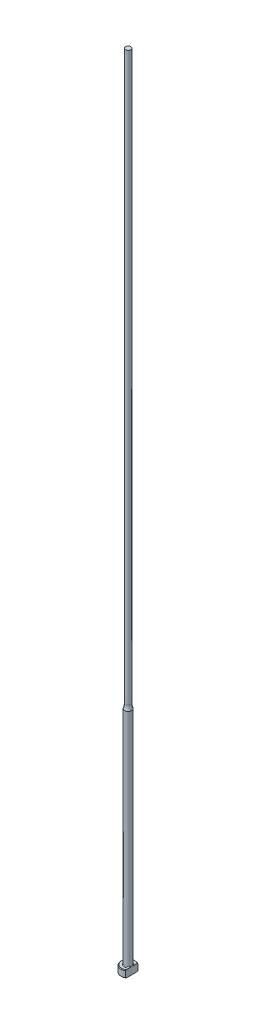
ISO-10303-21;
HEADER;
FILE_DESCRIPTION(('STEP AP214'),'2;1');
FILE_NAME('part.step','',(''),(''),'','','');
FILE_SCHEMA(('AUTOMOTIVE_DESIGN { 1 0 10303 214 1 1 1 1 }'));
ENDSEC;
DATA;
#1=APPLICATION_CONTEXT('core data for automotive mechanical design processes');
#2=APPLICATION_PROTOCOL_DEFINITION('international standard','automotive_design',2000,#1);
#3=PRODUCT_CONTEXT('',#1,'mechanical');
#4=PRODUCT('Part','Part','',(#3));
#5=PRODUCT_RELATED_PRODUCT_CATEGORY('part','',(#4));
#6=PRODUCT_DEFINITION_FORMATION('','',#4);
#7=PRODUCT_DEFINITION_CONTEXT('part definition',#1,'design');
#8=PRODUCT_DEFINITION('design','',#6,#7);
#9=PRODUCT_DEFINITION_SHAPE('','',#8);
#10=(LENGTH_UNIT() NAMED_UNIT(*) SI_UNIT(.MILLI.,.METRE.));
#11=(NAMED_UNIT(*) PLANE_ANGLE_UNIT() SI_UNIT($,.RADIAN.));
#12=(NAMED_UNIT(*) SI_UNIT($,.STERADIAN.) SOLID_ANGLE_UNIT());
#13=UNCERTAINTY_MEASURE_WITH_UNIT(LENGTH_MEASURE(1.E-05),#10,'distance_accuracy_value','');
#14=(GEOMETRIC_REPRESENTATION_CONTEXT(3) GLOBAL_UNCERTAINTY_ASSIGNED_CONTEXT((#13)) GLOBAL_UNIT_ASSIGNED_CONTEXT((#10,
#11,#12)) REPRESENTATION_CONTEXT('',''));
#15=CARTESIAN_POINT('',(0.,0.,0.));
#16=DIRECTION('',(0.,0.,1.));
#17=DIRECTION('',(1.,0.,0.));
#18=AXIS2_PLACEMENT_3D('',#15,#16,#17);
#19=CARTESIAN_POINT('',(-3.17499999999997,3.175,0.));
#20=DIRECTION('',(0.,1.,0.));
#21=DIRECTION('',(0.,0.,1.));
#22=AXIS2_PLACEMENT_3D('',#19,#20,#21);
#23=PLANE('',#22);
#24=CARTESIAN_POINT('',(0.,3.175,0.));
#25=DIRECTION('',(0.,1.,0.));
#26=DIRECTION('',(0.,0.,1.));
#27=AXIS2_PLACEMENT_3D('',#24,#25,#26);
#28=CIRCLE('',#27,2.92099999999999);
#29=CARTESIAN_POINT('',(1.58749999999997,3.175,-2.4519552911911));
#30=VERTEX_POINT('',#29);
#31=CARTESIAN_POINT('',(1.58749999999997,3.175,2.4519552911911));
#32=VERTEX_POINT('',#31);
#33=EDGE_CURVE('E105',#30,#32,#28,.T.);
#34=ORIENTED_EDGE('',*,*,#33,.T.);
#35=DIRECTION('',(0.,0.,1.));
#36=VECTOR('',#35,1.);
#37=CARTESIAN_POINT('',(1.58749999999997,3.17499999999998,2.74963065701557));
#38=LINE('',#37,#36);
#39=CARTESIAN_POINT('',(1.58749999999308,3.175,0.933255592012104));
#40=VERTEX_POINT('',#39);
#41=EDGE_CURVE('E126',#40,#32,#38,.T.);
#42=ORIENTED_EDGE('',*,*,#41,.F.);
#43=CARTESIAN_POINT('',(0.,3.175,0.));
#44=DIRECTION('',(0.,1.,0.));
#45=DIRECTION('',(0.,0.,1.));
#46=AXIS2_PLACEMENT_3D('',#43,#44,#45);
#47=CIRCLE('',#46,1.84149999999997);
#48=CARTESIAN_POINT('',(1.58749999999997,3.17500000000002,-0.933255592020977));
#49=VERTEX_POINT('',#48);
#50=EDGE_CURVE('E11',#40,#49,#47,.F.);
#51=ORIENTED_EDGE('',*,*,#50,.T.);
#52=EDGE_CURVE('E52',#30,#49,#38,.T.);
#53=ORIENTED_EDGE('',*,*,#52,.F.);
#54=EDGE_LOOP('',(#34,#42,#51,#53));
#55=FACE_BOUND('',#54,.T.);
#56=ADVANCED_FACE('F32',(#55),#23,.T.);
#57=CARTESIAN_POINT('',(0.,259.958771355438,0.));
#58=DIRECTION('',(0.,1.,0.));
#59=DIRECTION('',(0.,0.,1.));
#60=AXIS2_PLACEMENT_3D('',#57,#58,#59);
#61=CYLINDRICAL_SURFACE('',#60,3.17499999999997);
#62=CARTESIAN_POINT('',(0.,2.92100000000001,0.));
#63=DIRECTION('',(0.,1.,0.));
#64=DIRECTION('',(0.,0.,1.));
#65=AXIS2_PLACEMENT_3D('',#62,#63,#64);
#66=CIRCLE('',#65,3.17499999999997);
#67=CARTESIAN_POINT('',(1.58749999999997,2.92100000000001,2.74963065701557));
#68=VERTEX_POINT('',#67);
#69=CARTESIAN_POINT('',(1.58749999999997,2.92100000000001,-2.74963065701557));
#70=VERTEX_POINT('',#69);
#71=EDGE_CURVE('E98',#68,#70,#66,.F.);
#72=ORIENTED_EDGE('',*,*,#71,.T.);
#73=DIRECTION('',(0.,-1.,0.));
#74=VECTOR('',#73,1.);
#75=CARTESIAN_POINT('',(1.58749999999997,355.601,-2.74963065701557));
#76=LINE('',#75,#74);
#77=CARTESIAN_POINT('',(1.58749999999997,0.253999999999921,-2.74963065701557));
#78=VERTEX_POINT('',#77);
#79=EDGE_CURVE('E141',#70,#78,#76,.T.);
#80=ORIENTED_EDGE('',*,*,#79,.T.);
#81=CARTESIAN_POINT('',(0.,0.253999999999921,0.));
#82=DIRECTION('',(0.,-1.,0.));
#83=DIRECTION('',(0.,0.,-1.));
#84=AXIS2_PLACEMENT_3D('',#81,#82,#83);
#85=CIRCLE('',#84,3.17499999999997);
#86=CARTESIAN_POINT('',(1.58749999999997,0.253999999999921,2.74963065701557));
#87=VERTEX_POINT('',#86);
#88=EDGE_CURVE('E95',#78,#87,#85,.F.);
#89=ORIENTED_EDGE('',*,*,#88,.T.);
#90=DIRECTION('',(0.,-1.,0.));
#91=VECTOR('',#90,1.);
#92=CARTESIAN_POINT('',(1.58749999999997,355.601,2.74963065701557));
#93=LINE('',#92,#91);
#94=EDGE_CURVE('E88',#68,#87,#93,.T.);
#95=ORIENTED_EDGE('',*,*,#94,.F.);
#96=EDGE_LOOP('',(#72,#80,#89,#95));
#97=FACE_BOUND('',#96,.T.);
#98=ADVANCED_FACE('F191',(#97),#61,.T.);
#99=CARTESIAN_POINT('',(0.,0.,0.));
#100=DIRECTION('',(0.,-1.,0.));
#101=DIRECTION('',(0.,0.,-1.));
#102=AXIS2_PLACEMENT_3D('',#99,#100,#101);
#103=PLANE('',#102);
#104=CARTESIAN_POINT('',(0.,0.,0.));
#105=DIRECTION('',(0.,-1.,0.));
#106=DIRECTION('',(0.,0.,-1.));
#107=AXIS2_PLACEMENT_3D('',#104,#105,#106);
#108=CIRCLE('',#107,2.92100000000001);
#109=CARTESIAN_POINT('',(1.58749999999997,0.,2.45195529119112));
#110=VERTEX_POINT('',#109);
#111=CARTESIAN_POINT('',(1.58749999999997,0.,-2.45195529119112));
#112=VERTEX_POINT('',#111);
#113=EDGE_CURVE('E93',#110,#112,#108,.T.);
#114=ORIENTED_EDGE('',*,*,#113,.T.);
#115=DIRECTION('',(0.,0.,1.));
#116=VECTOR('',#115,1.);
#117=CARTESIAN_POINT('',(1.58749999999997,0.,2.74963065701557));
#118=LINE('',#117,#116);
#119=EDGE_CURVE('E78',#112,#110,#118,.T.);
#120=ORIENTED_EDGE('',*,*,#119,.T.);
#121=EDGE_LOOP('',(#114,#120));
#122=FACE_BOUND('',#121,.T.);
#123=ADVANCED_FACE('F97',(#122),#103,.T.);
#124=CARTESIAN_POINT('',(0.,3.17499999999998,0.));
#125=DIRECTION('',(0.,-1.,0.));
#126=DIRECTION('',(0.,0.,-1.));
#127=AXIS2_PLACEMENT_3D('',#124,#125,#126);
#128=CONICAL_SURFACE('',#127,2.92100000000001,0.785398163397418);
#129=ORIENTED_EDGE('',*,*,#71,.F.);
#130=CARTESIAN_POINT('',(1.58749999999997,-0.161620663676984,-6.0529050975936));
#131=CARTESIAN_POINT('',(1.58749999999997,-0.0288893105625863,-5.91567682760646));
#132=CARTESIAN_POINT('',(1.58749999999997,0.103699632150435,-5.77831035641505));
#133=CARTESIAN_POINT('',(1.58749999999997,0.368508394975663,-5.50321874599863));
#134=CARTESIAN_POINT('',(1.58749999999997,0.5007282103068,-5.3654936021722));
#135=CARTESIAN_POINT('',(1.58749999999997,0.764778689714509,-5.08953516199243));
#136=CARTESIAN_POINT('',(1.58749999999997,0.896609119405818,-4.95130164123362));
#137=CARTESIAN_POINT('',(1.58749999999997,1.15968706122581,-4.67428233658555));
#138=CARTESIAN_POINT('',(1.58749999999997,1.29093457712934,-4.5354965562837));
#139=CARTESIAN_POINT('',(1.58749999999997,1.55007705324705,-4.25997724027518));
#140=CARTESIAN_POINT('',(1.58749999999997,1.67798684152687,-4.12325766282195));
#141=CARTESIAN_POINT('',(1.58749999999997,1.9328486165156,-3.84892898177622));
#142=CARTESIAN_POINT('',(1.58749999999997,2.05980060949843,-3.71131988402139));
#143=CARTESIAN_POINT('',(1.58749999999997,2.31237508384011,-3.43493978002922));
#144=CARTESIAN_POINT('',(1.58749999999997,2.43799784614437,-3.29616903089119));
#145=CARTESIAN_POINT('',(1.58749999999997,2.68741369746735,-3.01699558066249));
#146=CARTESIAN_POINT('',(1.58749999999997,2.81120686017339,-2.8765929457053));
#147=CARTESIAN_POINT('',(1.58749999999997,3.00875865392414,-2.64816703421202));
#148=CARTESIAN_POINT('',(1.58749999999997,3.08336151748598,-2.56087478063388));
#149=CARTESIAN_POINT('',(1.58749999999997,3.23123871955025,-2.385154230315));
#150=CARTESIAN_POINT('',(1.58749999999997,3.30451292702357,-2.29672582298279));
#151=CARTESIAN_POINT('',(1.58749999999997,3.45004422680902,-2.11747400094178));
#152=CARTESIAN_POINT('',(1.58749999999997,3.52228237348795,-2.02663514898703));
#153=CARTESIAN_POINT('',(1.58749999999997,3.66423097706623,-1.84302524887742));
#154=CARTESIAN_POINT('',(1.58749999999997,3.73394203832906,-1.75025467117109));
#155=CARTESIAN_POINT('',(1.58749999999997,3.87080633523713,-1.56067475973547));
#156=CARTESIAN_POINT('',(1.58749999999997,3.93790459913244,-1.46382547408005));
#157=CARTESIAN_POINT('',(1.58749999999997,4.06669147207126,-1.26632594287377));
#158=CARTESIAN_POINT('',(1.58749999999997,4.12837264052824,-1.16567073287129));
#159=CARTESIAN_POINT('',(1.58749999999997,4.21402252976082,-1.01165766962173));
#160=CARTESIAN_POINT('',(1.58749999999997,4.2412792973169,-0.960142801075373));
#161=CARTESIAN_POINT('',(1.58749999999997,4.29309798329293,-0.85578092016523));
#162=CARTESIAN_POINT('',(1.58749999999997,4.3176594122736,-0.802933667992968));
#163=CARTESIAN_POINT('',(1.58749999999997,4.38614656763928,-0.642461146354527));
#164=CARTESIAN_POINT('',(1.58749999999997,4.42510149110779,-0.532518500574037));
#165=CARTESIAN_POINT('',(1.58749999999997,4.46726244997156,-0.367680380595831));
#166=CARTESIAN_POINT('',(1.58749999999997,4.47844427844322,-0.314802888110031));
#167=CARTESIAN_POINT('',(1.58749999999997,4.49576654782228,-0.208209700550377));
#168=CARTESIAN_POINT('',(1.58749999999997,4.50190743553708,-0.154494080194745));
#169=CARTESIAN_POINT('',(1.58749999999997,4.50871296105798,-0.0468792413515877));
#170=CARTESIAN_POINT('',(1.58749999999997,4.50939451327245,0.00701889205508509));
#171=CARTESIAN_POINT('',(1.58749999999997,4.5052767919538,0.114606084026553));
#172=CARTESIAN_POINT('',(1.58749999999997,4.5004770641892,0.16829512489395));
#173=CARTESIAN_POINT('',(1.58749999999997,4.48579689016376,0.274485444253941));
#174=CARTESIAN_POINT('',(1.58749999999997,4.47596081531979,0.326992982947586));
#175=CARTESIAN_POINT('',(1.58749999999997,4.4518180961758,0.430974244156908));
#176=CARTESIAN_POINT('',(1.58749999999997,4.43750969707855,0.482447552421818));
#177=CARTESIAN_POINT('',(1.58749999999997,4.40502489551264,0.58446088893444));
#178=CARTESIAN_POINT('',(1.58749999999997,4.38682724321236,0.634994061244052));
#179=CARTESIAN_POINT('',(1.58749999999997,4.34729308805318,0.734789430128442));
#180=CARTESIAN_POINT('',(1.58749999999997,4.32595722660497,0.784051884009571));
#181=CARTESIAN_POINT('',(1.58749999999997,4.25791922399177,0.93054934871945));
#182=CARTESIAN_POINT('',(1.58749999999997,4.20736047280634,1.02598802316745));
#183=CARTESIAN_POINT('',(1.58749999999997,4.09955451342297,1.21304313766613));
#184=CARTESIAN_POINT('',(1.58749999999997,4.04229912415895,1.30465471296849));
#185=CARTESIAN_POINT('',(1.58749999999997,3.92308746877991,1.48526211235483));
#186=CARTESIAN_POINT('',(1.58749999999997,3.86111349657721,1.57424615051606));
#187=CARTESIAN_POINT('',(1.58749999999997,3.73408621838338,1.74990003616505));
#188=CARTESIAN_POINT('',(1.58749999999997,3.66903444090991,1.83657099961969));
#189=CARTESIAN_POINT('',(1.58749999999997,3.53583371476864,2.009317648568));
#190=CARTESIAN_POINT('',(1.58749999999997,3.46765527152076,2.09537048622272));
#191=CARTESIAN_POINT('',(1.58749999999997,3.32960643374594,2.26611736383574));
#192=CARTESIAN_POINT('',(1.58749999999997,3.25973586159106,2.35081125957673));
#193=CARTESIAN_POINT('',(1.58749999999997,3.04858139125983,2.60290121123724));
#194=CARTESIAN_POINT('',(1.58749999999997,2.90542388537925,2.7687253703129));
#195=CARTESIAN_POINT('',(1.58749999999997,2.64069522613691,3.06970913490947));
#196=CARTESIAN_POINT('',(1.58749999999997,2.5195945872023,3.20528660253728));
#197=CARTESIAN_POINT('',(1.58749999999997,2.27590400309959,3.47510321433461));
#198=CARTESIAN_POINT('',(1.58749999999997,2.1533140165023,3.60934232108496));
#199=CARTESIAN_POINT('',(1.58749999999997,1.9069423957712,3.87695374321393));
#200=CARTESIAN_POINT('',(1.58749999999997,1.78315974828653,4.01032512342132));
#201=CARTESIAN_POINT('',(1.58749999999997,1.53478104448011,4.2763088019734));
#202=CARTESIAN_POINT('',(1.58749999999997,1.41018498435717,4.40892109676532));
#203=CARTESIAN_POINT('',(1.58749999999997,1.04574684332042,4.79499418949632));
#204=CARTESIAN_POINT('',(1.58749999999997,0.805076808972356,5.04767313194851));
#205=CARTESIAN_POINT('',(1.58749999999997,0.44312150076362,5.42550911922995));
#206=CARTESIAN_POINT('',(1.58749999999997,0.322378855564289,5.55118772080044));
#207=CARTESIAN_POINT('',(1.58749999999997,0.0805914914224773,5.8022520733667));
#208=CARTESIAN_POINT('',(1.58749999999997,-0.0404532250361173,5.92763782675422));
#209=CARTESIAN_POINT('',(1.58749999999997,-0.161620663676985,6.0529050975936));
#210=B_SPLINE_CURVE_WITH_KNOTS('',3,(#130,#131,#132,#133,#134,#135,#136,#137,#138,#139,#140,
#141,#142,#143,#144,#145,#146,#147,#148,#149,#150,#151,#152,#153,#154,#155,#156,#157,#158,#159,
#160,#161,#162,#163,#164,#165,#166,#167,#168,#169,#170,#171,#172,#173,#174,#175,#176,#177,#178,
#179,#180,#181,#182,#183,#184,#185,#186,#187,#188,#189,#190,#191,#192,#193,#194,#195,#196,#197,
#198,#199,#200,#201,#202,#203,#204,#205,#206,#207,#208,#209),.UNSPECIFIED.,.F.,.F.,(4,2,2,2,2,2,
2,2,2,2,2,2,2,2,2,2,2,2,2,2,2,2,2,2,2,2,2,2,2,2,2,2,2,2,2,2,2,2,2,4),(0.,0.572750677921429,
1.14550874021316,1.71856057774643,2.29160869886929,2.85328006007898,3.41494773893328,
3.97649423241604,4.53801804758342,4.88249307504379,5.2270018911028,5.57515326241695,
5.92322081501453,6.27657800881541,6.63041319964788,6.80518126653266,6.97998101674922,
7.32824262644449,7.49018491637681,7.65211285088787,7.81353889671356,7.97497832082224,
8.13501929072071,8.29512313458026,8.45612518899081,8.61709438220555,8.94062993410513,
9.26456495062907,9.58978187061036,9.91483894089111,10.2441741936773,10.5735441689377,
11.2306812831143,11.7760337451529,12.3214014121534,12.8672825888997,13.4131663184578,
14.4600164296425,14.9828595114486,15.505698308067),.UNSPECIFIED.);
#211=EDGE_CURVE('E118',#32,#68,#210,.T.);
#212=ORIENTED_EDGE('',*,*,#211,.F.);
#213=ORIENTED_EDGE('',*,*,#33,.F.);
#214=EDGE_CURVE('E117',#70,#30,#210,.T.);
#215=ORIENTED_EDGE('',*,*,#214,.F.);
#216=EDGE_LOOP('',(#129,#212,#213,#215));
#217=FACE_BOUND('',#216,.T.);
#218=ADVANCED_FACE('F162',(#217),#128,.T.);
#219=CARTESIAN_POINT('',(0.,0.253999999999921,0.));
#220=DIRECTION('',(0.,1.,0.));
#221=DIRECTION('',(0.,0.,1.));
#222=AXIS2_PLACEMENT_3D('',#219,#220,#221);
#223=CONICAL_SURFACE('',#222,3.17499999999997,0.785398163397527);
#224=ORIENTED_EDGE('',*,*,#88,.F.);
#225=CARTESIAN_POINT('',(1.58749999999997,3.33662066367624,6.0529050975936));
#226=CARTESIAN_POINT('',(1.58749999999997,3.20388931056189,5.91567682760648));
#227=CARTESIAN_POINT('',(1.58749999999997,3.07130036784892,5.7783103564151));
#228=CARTESIAN_POINT('',(1.58749999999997,2.80649160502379,5.50321874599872));
#229=CARTESIAN_POINT('',(1.58749999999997,2.6742717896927,5.36549360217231));
#230=CARTESIAN_POINT('',(1.58749999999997,2.41022131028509,5.08953516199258));
#231=CARTESIAN_POINT('',(1.58749999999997,2.27839088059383,4.95130164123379));
#232=CARTESIAN_POINT('',(1.58749999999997,2.01531293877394,4.67428233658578));
#233=CARTESIAN_POINT('',(1.58749999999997,1.88406542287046,4.53549655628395));
#234=CARTESIAN_POINT('',(1.58749999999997,1.62492294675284,4.25997724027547));
#235=CARTESIAN_POINT('',(1.58749999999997,1.49701315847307,4.12325766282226));
#236=CARTESIAN_POINT('',(1.58749999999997,1.24215138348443,3.84892898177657));
#237=CARTESIAN_POINT('',(1.58749999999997,1.11519939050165,3.71131988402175));
#238=CARTESIAN_POINT('',(1.58749999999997,0.862624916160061,3.43493978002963));
#239=CARTESIAN_POINT('',(1.58749999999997,0.737002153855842,3.29616903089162));
#240=CARTESIAN_POINT('',(1.58749999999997,0.487586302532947,3.01699558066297));
#241=CARTESIAN_POINT('',(1.58749999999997,0.363793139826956,2.8765929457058));
#242=CARTESIAN_POINT('',(1.58749999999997,0.166241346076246,2.64816703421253));
#243=CARTESIAN_POINT('',(1.58749999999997,0.0916384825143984,2.56087478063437));
#244=CARTESIAN_POINT('',(1.58749999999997,-0.0562387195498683,2.38515423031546));
#245=CARTESIAN_POINT('',(1.58749999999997,-0.129512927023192,2.29672582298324));
#246=CARTESIAN_POINT('',(1.58749999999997,-0.275044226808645,2.1174740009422));
#247=CARTESIAN_POINT('',(1.58749999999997,-0.347282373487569,2.02663514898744));
#248=CARTESIAN_POINT('',(1.58749999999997,-0.489230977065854,1.8430252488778));
#249=CARTESIAN_POINT('',(1.58749999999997,-0.558942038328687,1.75025467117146));
#250=CARTESIAN_POINT('',(1.58749999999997,-0.695806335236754,1.5606747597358));
#251=CARTESIAN_POINT('',(1.58749999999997,-0.762904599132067,1.46382547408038));
#252=CARTESIAN_POINT('',(1.58749999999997,-0.89169147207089,1.26632594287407));
#253=CARTESIAN_POINT('',(1.58749999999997,-0.953372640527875,1.16567073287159));
#254=CARTESIAN_POINT('',(1.58749999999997,-1.03902252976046,1.01165766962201));
#255=CARTESIAN_POINT('',(1.58749999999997,-1.06627929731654,0.960142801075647));
#256=CARTESIAN_POINT('',(1.58749999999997,-1.11809798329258,0.855780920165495));
#257=CARTESIAN_POINT('',(1.58749999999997,-1.14265941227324,0.802933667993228));
#258=CARTESIAN_POINT('',(1.58749999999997,-1.21114656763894,0.642461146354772));
#259=CARTESIAN_POINT('',(1.58749999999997,-1.25010149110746,0.532518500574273));
#260=CARTESIAN_POINT('',(1.58749999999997,-1.29226244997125,0.367680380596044));
#261=CARTESIAN_POINT('',(1.58749999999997,-1.30344427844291,0.314802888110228));
#262=CARTESIAN_POINT('',(1.58749999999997,-1.32076654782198,0.208209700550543));
#263=CARTESIAN_POINT('',(1.58749999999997,-1.32690743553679,0.154494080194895));
#264=CARTESIAN_POINT('',(1.58749999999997,-1.3337129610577,0.0468792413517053));
#265=CARTESIAN_POINT('',(1.58749999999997,-1.33439451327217,-0.00701889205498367));
#266=CARTESIAN_POINT('',(1.58749999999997,-1.33027679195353,-0.114606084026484));
#267=CARTESIAN_POINT('',(1.58749999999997,-1.32547706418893,-0.168295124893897));
#268=CARTESIAN_POINT('',(1.58749999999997,-1.31079689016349,-0.274485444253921));
#269=CARTESIAN_POINT('',(1.58749999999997,-1.30096081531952,-0.326992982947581));
#270=CARTESIAN_POINT('',(1.58749999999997,-1.27681809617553,-0.430974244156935));
#271=CARTESIAN_POINT('',(1.58749999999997,-1.26250969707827,-0.48244755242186));
#272=CARTESIAN_POINT('',(1.58749999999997,-1.23002489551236,-0.584460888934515));
#273=CARTESIAN_POINT('',(1.58749999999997,-1.21182724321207,-0.634994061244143));
#274=CARTESIAN_POINT('',(1.58749999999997,-1.17229308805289,-0.734789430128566));
#275=CARTESIAN_POINT('',(1.58749999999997,-1.15095722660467,-0.784051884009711));
#276=CARTESIAN_POINT('',(1.58749999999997,-1.08291922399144,-0.930549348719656));
#277=CARTESIAN_POINT('',(1.58749999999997,-1.03236047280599,-1.0259880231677));
#278=CARTESIAN_POINT('',(1.58749999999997,-0.924554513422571,-1.21304313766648));
#279=CARTESIAN_POINT('',(1.58749999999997,-0.867299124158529,-1.30465471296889));
#280=CARTESIAN_POINT('',(1.58749999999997,-0.748087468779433,-1.48526211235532));
#281=CARTESIAN_POINT('',(1.58749999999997,-0.686113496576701,-1.5742461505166));
#282=CARTESIAN_POINT('',(1.58749999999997,-0.559086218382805,-1.74990003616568));
#283=CARTESIAN_POINT('',(1.58749999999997,-0.494034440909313,-1.83657099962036));
#284=CARTESIAN_POINT('',(1.58749999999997,-0.360833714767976,-2.00931764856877));
#285=CARTESIAN_POINT('',(1.58749999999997,-0.292655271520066,-2.09537048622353));
#286=CARTESIAN_POINT('',(1.58749999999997,-0.154606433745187,-2.26611736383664));
#287=CARTESIAN_POINT('',(1.58749999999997,-0.0847358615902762,-2.35081125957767));
#288=CARTESIAN_POINT('',(1.58749999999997,0.126418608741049,-2.60290121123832));
#289=CARTESIAN_POINT('',(1.58749999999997,0.269576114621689,-2.76872537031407));
#290=CARTESIAN_POINT('',(1.58749999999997,0.534304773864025,-3.06970913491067));
#291=CARTESIAN_POINT('',(1.58749999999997,0.655405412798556,-3.20528660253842));
#292=CARTESIAN_POINT('',(1.58749999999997,0.899095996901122,-3.47510321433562));
#293=CARTESIAN_POINT('',(1.58749999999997,1.02168598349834,-3.60934232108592));
#294=CARTESIAN_POINT('',(1.58749999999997,1.26805760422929,-3.87695374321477));
#295=CARTESIAN_POINT('',(1.58749999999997,1.39184025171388,-4.0103251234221));
#296=CARTESIAN_POINT('',(1.58749999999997,1.64021895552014,-4.27630880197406));
#297=CARTESIAN_POINT('',(1.58749999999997,1.76481501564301,-4.40892109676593));
#298=CARTESIAN_POINT('',(1.58749999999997,2.12925315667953,-4.79499418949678));
#299=CARTESIAN_POINT('',(1.58749999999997,2.36992319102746,-5.04767313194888));
#300=CARTESIAN_POINT('',(1.58749999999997,2.73187849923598,-5.42550911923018));
#301=CARTESIAN_POINT('',(1.58749999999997,2.85262114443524,-5.55118772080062));
#302=CARTESIAN_POINT('',(1.58749999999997,3.09440850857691,-5.80225207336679));
#303=CARTESIAN_POINT('',(1.58749999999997,3.21545322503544,-5.92763782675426));
#304=CARTESIAN_POINT('',(1.58749999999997,3.33662066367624,-6.0529050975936));
#305=B_SPLINE_CURVE_WITH_KNOTS('',3,(#225,#226,#227,#228,#229,#230,#231,#232,#233,#234,#235,
#236,#237,#238,#239,#240,#241,#242,#243,#244,#245,#246,#247,#248,#249,#250,#251,#252,#253,#254,
#255,#256,#257,#258,#259,#260,#261,#262,#263,#264,#265,#266,#267,#268,#269,#270,#271,#272,#273,
#274,#275,#276,#277,#278,#279,#280,#281,#282,#283,#284,#285,#286,#287,#288,#289,#290,#291,#292,
#293,#294,#295,#296,#297,#298,#299,#300,#301,#302,#303,#304),.UNSPECIFIED.,.F.,.F.,(4,2,2,2,2,2,
2,2,2,2,2,2,2,2,2,2,2,2,2,2,2,2,2,2,2,2,2,2,2,2,2,2,2,2,2,2,2,2,2,4),(0.,0.572750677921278,
1.14550874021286,1.71856057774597,2.29160869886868,2.85328006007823,3.4149477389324,
3.97649423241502,4.53801804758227,4.88249307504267,5.22700189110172,5.5751532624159,
5.92322081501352,6.27657800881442,6.63041319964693,6.80518126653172,6.9799810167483,
7.3282426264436,7.49018491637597,7.65211285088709,7.81353889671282,7.97497832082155,
8.13501929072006,8.29512313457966,8.45612518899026,8.61709438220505,8.9406299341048,
9.2645649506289,9.58978187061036,9.91483894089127,10.2441741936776,10.5735441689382,
11.2306812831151,11.7760337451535,12.3214014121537,12.8672825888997,13.4131663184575,
14.4600164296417,14.9828595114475,15.5056983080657),.UNSPECIFIED.);
#306=EDGE_CURVE('E81',#112,#78,#305,.T.);
#307=ORIENTED_EDGE('',*,*,#306,.F.);
#308=ORIENTED_EDGE('',*,*,#113,.F.);
#309=EDGE_CURVE('E84',#87,#110,#305,.T.);
#310=ORIENTED_EDGE('',*,*,#309,.F.);
#311=EDGE_LOOP('',(#224,#307,#308,#310));
#312=FACE_BOUND('',#311,.T.);
#313=ADVANCED_FACE('F92',(#312),#223,.T.);
#314=CARTESIAN_POINT('',(0.,3.42900000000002,0.));
#315=DIRECTION('',(0.,1.,0.));
#316=DIRECTION('',(0.,0.,1.));
#317=AXIS2_PLACEMENT_3D('',#314,#315,#316);
#318=TOROIDAL_SURFACE('',#317,1.84149999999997,0.254);
#319=CARTESIAN_POINT('',(1.58749999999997,3.42900000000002,0.));
#320=CARTESIAN_POINT('',(1.58749999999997,3.42899942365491,-1.9220514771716E-10));
#321=CARTESIAN_POINT('',(1.58749999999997,3.42899884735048,-1.2261161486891E-07));
#322=CARTESIAN_POINT('',(1.58749999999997,3.42899773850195,-5.09676365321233E-07));
#323=CARTESIAN_POINT('',(1.58749999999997,3.42899720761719,-7.78176328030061E-07));
#324=CARTESIAN_POINT('',(1.58749999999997,3.42899614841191,-1.42307272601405E-06));
#325=CARTESIAN_POINT('',(1.58749999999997,3.42899562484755,-1.80713867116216E-06));
#326=CARTESIAN_POINT('',(1.58749999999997,3.42899463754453,-2.63494846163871E-06));
#327=CARTESIAN_POINT('',(1.58749999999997,3.42899417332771,-3.07814756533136E-06));
#328=CARTESIAN_POINT('',(1.58749999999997,3.42899261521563,-4.66897357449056E-06));
#329=CARTESIAN_POINT('',(1.58749999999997,3.42899159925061,-5.89404908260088E-06));
#330=CARTESIAN_POINT('',(1.58749999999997,3.42898979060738,-8.42427511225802E-06));
#331=CARTESIAN_POINT('',(1.58749999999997,3.42898899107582,-9.7248057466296E-06));
#332=CARTESIAN_POINT('',(1.58749999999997,3.42898598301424,-1.48060601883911E-05));
#333=CARTESIAN_POINT('',(1.58749999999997,3.42898393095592,-1.86838281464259E-05));
#334=CARTESIAN_POINT('',(1.58749999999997,3.42898057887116,-2.63261117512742E-05));
#335=CARTESIAN_POINT('',(1.58749999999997,3.42897922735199,-3.00687417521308E-05));
#336=CARTESIAN_POINT('',(1.58749999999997,3.42897347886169,-4.60276298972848E-05));
#337=CARTESIAN_POINT('',(1.58749999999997,3.42896911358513,-5.8247019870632E-05));
#338=CARTESIAN_POINT('',(1.58749999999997,3.42896211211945,-8.11070097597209E-05));
#339=CARTESIAN_POINT('',(1.58749999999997,3.42895931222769,-9.16953114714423E-05));
#340=CARTESIAN_POINT('',(1.58749999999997,3.42893712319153,-0.000168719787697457));
#341=CARTESIAN_POINT('',(1.58749999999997,3.42890881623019,-0.000232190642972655));
#342=CARTESIAN_POINT('',(1.58749999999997,3.42880276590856,-0.000479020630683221));
#343=CARTESIAN_POINT('',(1.58749999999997,3.42873165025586,-0.00066443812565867));
#344=CARTESIAN_POINT('',(1.58749999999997,3.42845137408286,-0.0013844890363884));
#345=CARTESIAN_POINT('',(1.58749999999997,3.42823526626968,-0.00191701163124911));
#346=CARTESIAN_POINT('',(1.58749999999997,3.42735449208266,-0.00409774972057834));
#347=CARTESIAN_POINT('',(1.58749999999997,3.42669768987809,-0.00574830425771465));
#348=CARTESIAN_POINT('',(1.58749999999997,3.4174405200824,-0.0289985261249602));
#349=CARTESIAN_POINT('',(1.58749999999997,3.40878325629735,-0.0505816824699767));
#350=CARTESIAN_POINT('',(1.58749999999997,3.39189297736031,-0.0929947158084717));
#351=CARTESIAN_POINT('',(1.58749999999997,3.38365605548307,-0.11382315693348));
#352=CARTESIAN_POINT('',(1.58749999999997,3.36635393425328,-0.157956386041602));
#353=CARTESIAN_POINT('',(1.58749999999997,3.35730391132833,-0.181267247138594));
#354=CARTESIAN_POINT('',(1.58749999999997,3.33936775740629,-0.228222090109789));
#355=CARTESIAN_POINT('',(1.58749999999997,3.33048420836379,-0.25186705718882));
#356=CARTESIAN_POINT('',(1.58749999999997,3.30894496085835,-0.310512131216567));
#357=CARTESIAN_POINT('',(1.58749999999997,3.29649449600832,-0.345588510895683));
#358=CARTESIAN_POINT('',(1.58749999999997,3.27296975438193,-0.415278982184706));
#359=CARTESIAN_POINT('',(1.58749999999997,3.26186987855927,-0.449884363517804));
#360=CARTESIAN_POINT('',(1.58749999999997,3.2395832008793,-0.524471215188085));
#361=CARTESIAN_POINT('',(1.58749999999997,3.22860862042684,-0.564517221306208));
#362=CARTESIAN_POINT('',(1.58749999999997,3.20902534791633,-0.645529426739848));
#363=CARTESIAN_POINT('',(1.58749999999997,3.20043582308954,-0.686500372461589));
#364=CARTESIAN_POINT('',(1.58749999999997,3.18611712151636,-0.771546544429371));
#365=CARTESIAN_POINT('',(1.58749999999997,3.18059550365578,-0.815658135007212));
#366=CARTESIAN_POINT('',(1.58749999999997,3.17455396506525,-0.904117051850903));
#367=CARTESIAN_POINT('',(1.58749999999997,3.17401361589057,-0.948462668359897));
#368=CARTESIAN_POINT('',(1.58749999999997,3.17898948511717,-1.02531896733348));
#369=CARTESIAN_POINT('',(1.58749999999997,3.1829739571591,-1.05792141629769));
#370=CARTESIAN_POINT('',(1.58749999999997,3.19569167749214,-1.12184393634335));
#371=CARTESIAN_POINT('',(1.58749999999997,3.20436049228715,-1.1531753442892));
#372=CARTESIAN_POINT('',(1.58749999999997,3.22236152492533,-1.19946468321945));
#373=CARTESIAN_POINT('',(1.58749999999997,3.2295150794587,-1.21526783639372));
#374=CARTESIAN_POINT('',(1.58749999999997,3.24587062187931,-1.24583726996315));
#375=CARTESIAN_POINT('',(1.58749999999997,3.25507530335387,-1.26060215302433));
#376=CARTESIAN_POINT('',(1.58749999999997,3.27378481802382,-1.28575815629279));
#377=CARTESIAN_POINT('',(1.58749999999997,3.28289001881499,-1.29644383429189));
#378=CARTESIAN_POINT('',(1.58749999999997,3.30268460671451,-1.31623154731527));
#379=CARTESIAN_POINT('',(1.58749999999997,3.31337067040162,-1.32533681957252));
#380=CARTESIAN_POINT('',(1.58749999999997,3.33349977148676,-1.33941140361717));
#381=CARTESIAN_POINT('',(1.58749999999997,3.34261446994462,-1.34484814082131));
#382=CARTESIAN_POINT('',(1.58749999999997,3.36161455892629,-1.35416329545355));
#383=CARTESIAN_POINT('',(1.58749999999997,3.37149946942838,-1.35804267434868));
#384=CARTESIAN_POINT('',(1.58749999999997,3.39188678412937,-1.36398436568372));
#385=CARTESIAN_POINT('',(1.58749999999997,3.40239309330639,-1.36603350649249));
#386=CARTESIAN_POINT('',(1.58749999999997,3.42360372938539,-1.3680840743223));
#387=CARTESIAN_POINT('',(1.58749999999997,3.43430795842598,-1.36808648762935));
#388=CARTESIAN_POINT('',(1.58749999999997,3.45433283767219,-1.36616208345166));
#389=CARTESIAN_POINT('',(1.58749999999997,3.46367506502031,-1.36444960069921));
#390=CARTESIAN_POINT('',(1.58749999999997,3.48195519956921,-1.35953338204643));
#391=CARTESIAN_POINT('',(1.58749999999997,3.49089304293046,-1.3563294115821));
#392=CARTESIAN_POINT('',(1.58749999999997,3.50850302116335,-1.34848006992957));
#393=CARTESIAN_POINT('',(1.58749999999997,3.5171531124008,-1.34378578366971));
#394=CARTESIAN_POINT('',(1.58749999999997,3.53371257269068,-1.33324445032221));
#395=CARTESIAN_POINT('',(1.58749999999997,3.54162163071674,-1.32739692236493));
#396=CARTESIAN_POINT('',(1.58749999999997,3.56107121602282,-1.31107304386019));
#397=CARTESIAN_POINT('',(1.58749999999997,3.57202221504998,-1.29989286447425));
#398=CARTESIAN_POINT('',(1.58749999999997,3.59202509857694,-1.27593566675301));
#399=CARTESIAN_POINT('',(1.58749999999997,3.60107086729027,-1.26315370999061));
#400=CARTESIAN_POINT('',(1.58749999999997,3.62186023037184,-1.22930733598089));
#401=CARTESIAN_POINT('',(1.58749999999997,3.63240584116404,-1.20751096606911));
#402=CARTESIAN_POINT('',(1.58749999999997,3.65004643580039,-1.16266144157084));
#403=CARTESIAN_POINT('',(1.58749999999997,3.65714435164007,-1.13960937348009));
#404=CARTESIAN_POINT('',(1.58749999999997,3.67265428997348,-1.07603916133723));
#405=CARTESIAN_POINT('',(1.58749999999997,3.67834921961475,-1.03486686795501));
#406=CARTESIAN_POINT('',(1.58749999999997,3.68382880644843,-0.951558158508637));
#407=CARTESIAN_POINT('',(1.58749999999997,3.68350976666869,-0.909417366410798));
#408=CARTESIAN_POINT('',(1.58749999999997,3.67745397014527,-0.811383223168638));
#409=CARTESIAN_POINT('',(1.58749999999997,3.66993873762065,-0.755610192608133));
#410=CARTESIAN_POINT('',(1.58749999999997,3.64933373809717,-0.644937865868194));
#411=CARTESIAN_POINT('',(1.58749999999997,3.63621897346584,-0.59004364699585));
#412=CARTESIAN_POINT('',(1.58749999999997,3.60740922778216,-0.485757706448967));
#413=CARTESIAN_POINT('',(1.58749999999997,3.59201096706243,-0.436281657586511));
#414=CARTESIAN_POINT('',(1.58749999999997,3.55922497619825,-0.338551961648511));
#415=CARTESIAN_POINT('',(1.58749999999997,3.5418584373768,-0.290291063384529));
#416=CARTESIAN_POINT('',(1.58749999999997,3.51760237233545,-0.225557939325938));
#417=CARTESIAN_POINT('',(1.58749999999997,3.51126413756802,-0.208874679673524));
#418=CARTESIAN_POINT('',(1.58749999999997,3.49830042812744,-0.17512392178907));
#419=CARTESIAN_POINT('',(1.58749999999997,3.49167176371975,-0.158057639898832));
#420=CARTESIAN_POINT('',(1.58749999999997,3.47585523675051,-0.117638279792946));
#421=CARTESIAN_POINT('',(1.58749999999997,3.46662970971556,-0.0943002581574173));
#422=CARTESIAN_POINT('',(1.58749999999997,3.44889695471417,-0.0497824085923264));
#423=CARTESIAN_POINT('',(1.58749999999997,3.44040039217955,-0.028598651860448));
#424=CARTESIAN_POINT('',(1.58749999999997,3.43130364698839,-0.00575168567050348));
#425=CARTESIAN_POINT('',(1.58749999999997,3.43064818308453,-0.00410451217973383));
#426=CARTESIAN_POINT('',(1.58749999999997,3.42976776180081,-0.00192459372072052));
#427=CARTESIAN_POINT('',(1.58749999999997,3.42955062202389,-0.00138952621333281));
#428=CARTESIAN_POINT('',(1.58749999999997,3.42926908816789,-0.000666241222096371));
#429=CARTESIAN_POINT('',(1.58749999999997,3.42919771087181,-0.000480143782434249));
#430=CARTESIAN_POINT('',(1.58749999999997,3.42909131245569,-0.000232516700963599));
#431=CARTESIAN_POINT('',(1.58749999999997,3.42906294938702,-0.000168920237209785));
#432=CARTESIAN_POINT('',(1.58749999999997,3.42904072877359,-9.17527162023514E-05));
#433=CARTESIAN_POINT('',(1.58749999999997,3.42903792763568,-8.11550293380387E-05));
#434=CARTESIAN_POINT('',(1.58749999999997,3.42903091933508,-5.82743948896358E-05));
#435=CARTESIAN_POINT('',(1.58749999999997,3.42902654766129,-4.60440001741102E-05));
#436=CARTESIAN_POINT('',(1.58749999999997,3.42902079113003,-3.00727682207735E-05));
#437=CARTESIAN_POINT('',(1.58749999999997,3.42901943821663,-2.63286807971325E-05));
#438=CARTESIAN_POINT('',(1.58749999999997,3.42901608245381,-1.86836529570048E-05));
#439=CARTESIAN_POINT('',(1.58749999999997,3.4290140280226,-1.48046517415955E-05));
#440=CARTESIAN_POINT('',(1.58749999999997,3.42901101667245,-9.72223943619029E-06));
#441=CARTESIAN_POINT('',(1.58749999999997,3.42901021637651,-8.42159649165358E-06));
#442=CARTESIAN_POINT('',(1.58749999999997,3.42900840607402,-5.89129729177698E-06));
#443=CARTESIAN_POINT('',(1.58749999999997,3.42900738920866,-4.66626867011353E-06));
#444=CARTESIAN_POINT('',(1.58749999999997,3.42900582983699,-3.07568803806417E-06));
#445=CARTESIAN_POINT('',(1.58749999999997,3.42900536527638,-2.63259565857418E-06));
#446=CARTESIAN_POINT('',(1.58749999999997,3.4290043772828,-1.80506085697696E-06));
#447=CARTESIAN_POINT('',(1.58749999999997,3.42900385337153,-1.42116387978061E-06));
#448=CARTESIAN_POINT('',(1.58749999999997,3.42900279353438,-7.76675643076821E-07));
#449=CARTESIAN_POINT('',(1.58749999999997,3.42900226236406,-5.08406487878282E-07));
#450=CARTESIAN_POINT('',(1.58749999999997,3.42900115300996,-1.21901887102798E-07));
#451=CARTESIAN_POINT('',(1.58749999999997,3.42900057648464,1.92251677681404E-10));
#452=CARTESIAN_POINT('',(1.58749999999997,3.42900000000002,0.));
#453=B_SPLINE_CURVE_WITH_KNOTS('',3,(#319,#320,#321,#322,#323,#324,#325,#326,#327,#328,#329,
#330,#331,#332,#333,#334,#335,#336,#337,#338,#339,#340,#341,#342,#343,#344,#345,#346,#347,#348,
#349,#350,#351,#352,#353,#354,#355,#356,#357,#358,#359,#360,#361,#362,#363,#364,#365,#366,#367,
#368,#369,#370,#371,#372,#373,#374,#375,#376,#377,#378,#379,#380,#381,#382,#383,#384,#385,#386,
#387,#388,#389,#390,#391,#392,#393,#394,#395,#396,#397,#398,#399,#400,#401,#402,#403,#404,#405,
#406,#407,#408,#409,#410,#411,#412,#413,#414,#415,#416,#417,#418,#419,#420,#421,#422,#423,#424,
#425,#426,#427,#428,#429,#430,#431,#432,#433,#434,#435,#436,#437,#438,#439,#440,#441,#442,#443,
#444,#445,#446,#447,#448,#449,#450,#451,#452),.UNSPECIFIED.,.T.,.F.,(4,2,2,2,2,2,2,2,2,2,2,2,2,
2,2,2,2,2,2,2,2,2,2,2,2,2,2,2,2,2,2,2,2,2,2,2,2,2,2,2,2,2,2,2,2,2,2,2,2,2,2,2,2,2,2,2,2,2,2,2,2,
2,2,2,2,2,4),(0.,1.72815458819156E-06,3.50429255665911E-06,5.44431004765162E-06,
7.3675525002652E-06,1.2119089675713E-05,1.66953775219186E-05,2.98160400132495E-05,
4.17409564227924E-05,8.0660475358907E-05,0.000113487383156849,0.000321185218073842,
0.000917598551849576,0.00264089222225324,0.00797105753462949,0.0777276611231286,
0.144923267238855,0.219939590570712,0.295714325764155,0.407362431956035,0.516367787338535,
0.640878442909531,0.766362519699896,0.899536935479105,1.03216495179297,1.13045740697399,
1.22743103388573,1.27935899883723,1.33135556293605,1.37333248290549,1.41522237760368,
1.44693946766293,1.47863694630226,1.51056074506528,1.54246916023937,1.57083210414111,
1.59919951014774,1.62861579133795,1.65804436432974,1.70472658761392,1.75155645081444,
1.82378709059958,1.89595619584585,2.01995471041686,2.1460932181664,2.31447224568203,
2.48361094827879,2.6389891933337,2.79283011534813,2.84637031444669,2.9012946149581,
2.97658236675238,3.04504771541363,3.05036697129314,3.05209849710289,3.05269709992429,
3.05290520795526,3.05293806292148,3.05297701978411,3.05298895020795,3.05300207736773,
3.05300665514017,3.0530114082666,3.05301333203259,3.05301527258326,3.05301704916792,
3.05301877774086),.UNSPECIFIED.);
#454=CARTESIAN_POINT('',(1.58749999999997,3.42900000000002,0.));
#455=VERTEX_POINT('',#454);
#456=EDGE_CURVE('E47',#455,#49,#453,.T.);
#457=ORIENTED_EDGE('',*,*,#456,.T.);
#458=ORIENTED_EDGE('',*,*,#50,.F.);
#459=CARTESIAN_POINT('',(1.58749999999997,3.42900000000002,0.));
#460=CARTESIAN_POINT('',(1.58749999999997,3.42900057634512,1.9220512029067E-10));
#461=CARTESIAN_POINT('',(1.58749999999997,3.42900115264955,1.22611614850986E-07));
#462=CARTESIAN_POINT('',(1.58749999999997,3.42900226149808,5.09676365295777E-07));
#463=CARTESIAN_POINT('',(1.58749999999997,3.42900279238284,7.78176328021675E-07));
#464=CARTESIAN_POINT('',(1.58749999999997,3.42900385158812,1.42307272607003E-06));
#465=CARTESIAN_POINT('',(1.58749999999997,3.42900437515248,1.80713867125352E-06));
#466=CARTESIAN_POINT('',(1.58749999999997,3.4290053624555,2.63494846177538E-06));
#467=CARTESIAN_POINT('',(1.58749999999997,3.42900582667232,3.0781475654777E-06));
#468=CARTESIAN_POINT('',(1.58749999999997,3.4290073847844,4.66897357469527E-06));
#469=CARTESIAN_POINT('',(1.58749999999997,3.42900840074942,5.89404908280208E-06));
#470=CARTESIAN_POINT('',(1.58749999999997,3.42901020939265,8.42427511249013E-06));
#471=CARTESIAN_POINT('',(1.58749999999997,3.42901100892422,9.72480574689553E-06));
#472=CARTESIAN_POINT('',(1.58749999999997,3.42901401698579,1.48060601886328E-05));
#473=CARTESIAN_POINT('',(1.58749999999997,3.42901606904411,1.86838281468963E-05));
#474=CARTESIAN_POINT('',(1.58749999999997,3.42901942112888,2.63261117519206E-05));
#475=CARTESIAN_POINT('',(1.58749999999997,3.42902077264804,3.00687417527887E-05));
#476=CARTESIAN_POINT('',(1.58749999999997,3.42902652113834,4.60276298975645E-05));
#477=CARTESIAN_POINT('',(1.58749999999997,3.4290308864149,5.82470198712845E-05));
#478=CARTESIAN_POINT('',(1.58749999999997,3.42903788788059,8.11070097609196E-05));
#479=CARTESIAN_POINT('',(1.58749999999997,3.42904068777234,9.16953114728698E-05));
#480=CARTESIAN_POINT('',(1.58749999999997,3.4290628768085,0.000168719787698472));
#481=CARTESIAN_POINT('',(1.58749999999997,3.42909118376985,0.000232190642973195));
#482=CARTESIAN_POINT('',(1.58749999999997,3.42919723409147,0.000479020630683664));
#483=CARTESIAN_POINT('',(1.58749999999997,3.42926834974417,0.000664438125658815));
#484=CARTESIAN_POINT('',(1.58749999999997,3.42954862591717,0.00138448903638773));
#485=CARTESIAN_POINT('',(1.58749999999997,3.42976473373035,0.00191701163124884));
#486=CARTESIAN_POINT('',(1.58749999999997,3.43064550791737,0.00409774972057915));
#487=CARTESIAN_POINT('',(1.58749999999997,3.43130231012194,0.00574830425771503));
#488=CARTESIAN_POINT('',(1.58749999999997,3.44055947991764,0.0289985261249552));
#489=CARTESIAN_POINT('',(1.58749999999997,3.44921674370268,0.0505816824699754));
#490=CARTESIAN_POINT('',(1.58749999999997,3.46610702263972,0.0929947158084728));
#491=CARTESIAN_POINT('',(1.58749999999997,3.47434394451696,0.11382315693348));
#492=CARTESIAN_POINT('',(1.58749999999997,3.49164606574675,0.157956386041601));
#493=CARTESIAN_POINT('',(1.58749999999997,3.5006960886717,0.181267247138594));
#494=CARTESIAN_POINT('',(1.58749999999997,3.51863224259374,0.228222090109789));
#495=CARTESIAN_POINT('',(1.58749999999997,3.52751579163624,0.25186705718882));
#496=CARTESIAN_POINT('',(1.58749999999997,3.54905503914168,0.310512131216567));
#497=CARTESIAN_POINT('',(1.58749999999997,3.56150550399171,0.345588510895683));
#498=CARTESIAN_POINT('',(1.58749999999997,3.5850302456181,0.415278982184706));
#499=CARTESIAN_POINT('',(1.58749999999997,3.59613012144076,0.449884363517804));
#500=CARTESIAN_POINT('',(1.58749999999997,3.61841679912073,0.524471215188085));
#501=CARTESIAN_POINT('',(1.58749999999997,3.62939137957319,0.564517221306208));
#502=CARTESIAN_POINT('',(1.58749999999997,3.6489746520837,0.645529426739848));
#503=CARTESIAN_POINT('',(1.58749999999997,3.65756417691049,0.686500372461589));
#504=CARTESIAN_POINT('',(1.58749999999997,3.67188287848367,0.771546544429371));
#505=CARTESIAN_POINT('',(1.58749999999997,3.67740449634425,0.815658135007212));
#506=CARTESIAN_POINT('',(1.58749999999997,3.68344603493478,0.904117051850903));
#507=CARTESIAN_POINT('',(1.58749999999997,3.68398638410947,0.948462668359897));
#508=CARTESIAN_POINT('',(1.58749999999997,3.67901051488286,1.02531896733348));
#509=CARTESIAN_POINT('',(1.58749999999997,3.67502604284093,1.05792141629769));
#510=CARTESIAN_POINT('',(1.58749999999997,3.66230832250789,1.12184393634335));
#511=CARTESIAN_POINT('',(1.58749999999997,3.65363950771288,1.1531753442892));
#512=CARTESIAN_POINT('',(1.58749999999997,3.6356384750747,1.19946468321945));
#513=CARTESIAN_POINT('',(1.58749999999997,3.62848492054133,1.21526783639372));
#514=CARTESIAN_POINT('',(1.58749999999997,3.61212937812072,1.24583726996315));
#515=CARTESIAN_POINT('',(1.58749999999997,3.60292469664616,1.26060215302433));
#516=CARTESIAN_POINT('',(1.58749999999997,3.58421518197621,1.28575815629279));
#517=CARTESIAN_POINT('',(1.58749999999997,3.57510998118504,1.29644383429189));
#518=CARTESIAN_POINT('',(1.58749999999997,3.55531539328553,1.31623154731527));
#519=CARTESIAN_POINT('',(1.58749999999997,3.54462932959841,1.32533681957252));
#520=CARTESIAN_POINT('',(1.58749999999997,3.52450022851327,1.33941140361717));
#521=CARTESIAN_POINT('',(1.58749999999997,3.51538553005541,1.34484814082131));
#522=CARTESIAN_POINT('',(1.58749999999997,3.49638544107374,1.35416329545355));
#523=CARTESIAN_POINT('',(1.58749999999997,3.48650053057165,1.35804267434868));
#524=CARTESIAN_POINT('',(1.58749999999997,3.46611321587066,1.36398436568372));
#525=CARTESIAN_POINT('',(1.58749999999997,3.45560690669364,1.36603350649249));
#526=CARTESIAN_POINT('',(1.58749999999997,3.43439627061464,1.3680840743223));
#527=CARTESIAN_POINT('',(1.58749999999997,3.42369204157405,1.36808648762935));
#528=CARTESIAN_POINT('',(1.58749999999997,3.40366716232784,1.36616208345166));
#529=CARTESIAN_POINT('',(1.58749999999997,3.39432493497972,1.36444960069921));
#530=CARTESIAN_POINT('',(1.58749999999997,3.37604480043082,1.35953338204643));
#531=CARTESIAN_POINT('',(1.58749999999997,3.36710695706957,1.3563294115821));
#532=CARTESIAN_POINT('',(1.58749999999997,3.34949697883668,1.34848006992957));
#533=CARTESIAN_POINT('',(1.58749999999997,3.34084688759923,1.34378578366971));
#534=CARTESIAN_POINT('',(1.58749999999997,3.32428742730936,1.33324445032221));
#535=CARTESIAN_POINT('',(1.58749999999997,3.31637836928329,1.32739692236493));
#536=CARTESIAN_POINT('',(1.58749999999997,3.29692878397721,1.31107304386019));
#537=CARTESIAN_POINT('',(1.58749999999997,3.28597778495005,1.29989286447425));
#538=CARTESIAN_POINT('',(1.58749999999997,3.26597490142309,1.27593566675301));
#539=CARTESIAN_POINT('',(1.58749999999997,3.25692913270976,1.26315370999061));
#540=CARTESIAN_POINT('',(1.58749999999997,3.23613976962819,1.22930733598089));
#541=CARTESIAN_POINT('',(1.58749999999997,3.22559415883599,1.20751096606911));
#542=CARTESIAN_POINT('',(1.58749999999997,3.20795356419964,1.16266144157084));
#543=CARTESIAN_POINT('',(1.58749999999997,3.20085564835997,1.13960937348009));
#544=CARTESIAN_POINT('',(1.58749999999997,3.18534571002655,1.07603916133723));
#545=CARTESIAN_POINT('',(1.58749999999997,3.17965078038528,1.03486686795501));
#546=CARTESIAN_POINT('',(1.58749999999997,3.1741711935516,0.951558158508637));
#547=CARTESIAN_POINT('',(1.58749999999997,3.17449023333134,0.909417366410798));
#548=CARTESIAN_POINT('',(1.58749999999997,3.18054602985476,0.811383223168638));
#549=CARTESIAN_POINT('',(1.58749999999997,3.18806126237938,0.755610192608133));
#550=CARTESIAN_POINT('',(1.58749999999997,3.20866626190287,0.644937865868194));
#551=CARTESIAN_POINT('',(1.58749999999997,3.2217810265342,0.59004364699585));
#552=CARTESIAN_POINT('',(1.58749999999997,3.25059077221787,0.485757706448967));
#553=CARTESIAN_POINT('',(1.58749999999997,3.2659890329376,0.43628165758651));
#554=CARTESIAN_POINT('',(1.58749999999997,3.29877502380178,0.338551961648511));
#555=CARTESIAN_POINT('',(1.58749999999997,3.31614156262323,0.290291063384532));
#556=CARTESIAN_POINT('',(1.58749999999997,3.34039762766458,0.225557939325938));
#557=CARTESIAN_POINT('',(1.58749999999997,3.346735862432,0.208874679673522));
#558=CARTESIAN_POINT('',(1.58749999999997,3.35969957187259,0.175123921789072));
#559=CARTESIAN_POINT('',(1.58749999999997,3.3663282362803,0.15805763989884));
#560=CARTESIAN_POINT('',(1.58749999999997,3.3821447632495,0.117638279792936));
#561=CARTESIAN_POINT('',(1.58749999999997,3.39137029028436,0.0943002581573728));
#562=CARTESIAN_POINT('',(1.58749999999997,3.40910304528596,0.0497824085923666));
#563=CARTESIAN_POINT('',(1.58749999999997,3.41759960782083,0.0285986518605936));
#564=CARTESIAN_POINT('',(1.58749999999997,3.42669635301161,0.00575168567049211));
#565=CARTESIAN_POINT('',(1.58749999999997,3.42735181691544,0.00410451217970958));
#566=CARTESIAN_POINT('',(1.58749999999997,3.42823223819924,0.00192459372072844));
#567=CARTESIAN_POINT('',(1.58749999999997,3.42844937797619,0.00138952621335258));
#568=CARTESIAN_POINT('',(1.58749999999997,3.42873091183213,0.000666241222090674));
#569=CARTESIAN_POINT('',(1.58749999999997,3.42880228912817,0.000480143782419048));
#570=CARTESIAN_POINT('',(1.58749999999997,3.42890868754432,0.000232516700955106));
#571=CARTESIAN_POINT('',(1.58749999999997,3.42893705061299,0.000168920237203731));
#572=CARTESIAN_POINT('',(1.58749999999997,3.42895927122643,9.17527161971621E-05));
#573=CARTESIAN_POINT('',(1.58749999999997,3.42896207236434,8.1155029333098E-05));
#574=CARTESIAN_POINT('',(1.58749999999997,3.42896908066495,5.82743948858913E-05));
#575=CARTESIAN_POINT('',(1.58749999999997,3.42897345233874,4.60440001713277E-05));
#576=CARTESIAN_POINT('',(1.58749999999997,3.42897920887,3.00727682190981E-05));
#577=CARTESIAN_POINT('',(1.58749999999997,3.42898056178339,2.63286807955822E-05));
#578=CARTESIAN_POINT('',(1.58749999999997,3.42898391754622,1.86836529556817E-05));
#579=CARTESIAN_POINT('',(1.58749999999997,3.42898597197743,1.48046517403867E-05));
#580=CARTESIAN_POINT('',(1.58749999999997,3.42898898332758,9.72223943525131E-06));
#581=CARTESIAN_POINT('',(1.58749999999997,3.42898978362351,8.42159649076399E-06));
#582=CARTESIAN_POINT('',(1.58749999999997,3.42899159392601,5.89129729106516E-06));
#583=CARTESIAN_POINT('',(1.58749999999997,3.42899261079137,4.66626866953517E-06));
#584=CARTESIAN_POINT('',(1.58749999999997,3.42899417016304,3.0756880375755E-06));
#585=CARTESIAN_POINT('',(1.58749999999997,3.42899463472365,2.63259565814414E-06));
#586=CARTESIAN_POINT('',(1.58749999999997,3.42899562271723,1.80506085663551E-06));
#587=CARTESIAN_POINT('',(1.58749999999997,3.42899614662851,1.42116387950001E-06));
#588=CARTESIAN_POINT('',(1.58749999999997,3.42899720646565,7.7667564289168E-07));
#589=CARTESIAN_POINT('',(1.58749999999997,3.42899773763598,5.0840648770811E-07));
#590=CARTESIAN_POINT('',(1.58749999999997,3.42899884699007,1.21901887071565E-07));
#591=CARTESIAN_POINT('',(1.58749999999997,3.42899942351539,-1.92251650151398E-10));
#592=CARTESIAN_POINT('',(1.58749999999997,3.42900000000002,0.));
#593=B_SPLINE_CURVE_WITH_KNOTS('',3,(#459,#460,#461,#462,#463,#464,#465,#466,#467,#468,#469,
#470,#471,#472,#473,#474,#475,#476,#477,#478,#479,#480,#481,#482,#483,#484,#485,#486,#487,#488,
#489,#490,#491,#492,#493,#494,#495,#496,#497,#498,#499,#500,#501,#502,#503,#504,#505,#506,#507,
#508,#509,#510,#511,#512,#513,#514,#515,#516,#517,#518,#519,#520,#521,#522,#523,#524,#525,#526,
#527,#528,#529,#530,#531,#532,#533,#534,#535,#536,#537,#538,#539,#540,#541,#542,#543,#544,#545,
#546,#547,#548,#549,#550,#551,#552,#553,#554,#555,#556,#557,#558,#559,#560,#561,#562,#563,#564,
#565,#566,#567,#568,#569,#570,#571,#572,#573,#574,#575,#576,#577,#578,#579,#580,#581,#582,#583,
#584,#585,#586,#587,#588,#589,#590,#591,#592),.UNSPECIFIED.,.T.,.F.,(4,2,2,2,2,2,2,2,2,2,2,2,2,
2,2,2,2,2,2,2,2,2,2,2,2,2,2,2,2,2,2,2,2,2,2,2,2,2,2,2,2,2,2,2,2,2,2,2,2,2,2,2,2,2,2,2,2,2,2,2,2,
2,2,2,2,2,4),(0.,1.72815458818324E-06,3.50429255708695E-06,5.44431004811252E-06,
7.36755250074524E-06,1.21190896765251E-05,1.66953775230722E-05,2.98160400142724E-05,
4.17409564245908E-05,8.06604753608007E-05,0.000113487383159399,0.000321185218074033,
0.000917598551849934,0.00264089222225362,0.00797105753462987,0.077727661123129,
0.144923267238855,0.219939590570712,0.295714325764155,0.407362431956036,0.516367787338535,
0.640878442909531,0.766362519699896,0.899536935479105,1.03216495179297,1.13045740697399,
1.22743103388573,1.27935899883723,1.33135556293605,1.37333248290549,1.41522237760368,
1.44693946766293,1.47863694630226,1.51056074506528,1.54246916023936,1.57083210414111,
1.59919951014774,1.62861579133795,1.65804436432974,1.70472658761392,1.75155645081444,
1.82378709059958,1.89595619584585,2.01995471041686,2.1460932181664,2.31447224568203,
2.48361094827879,2.6389891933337,2.79283011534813,2.84637031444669,2.9012946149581,
2.97658236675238,3.04504771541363,3.05036697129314,3.05209849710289,3.05269709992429,
3.05290520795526,3.05293806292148,3.05297701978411,3.05298895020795,3.05300207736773,
3.05300665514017,3.0530114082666,3.05301333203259,3.05301527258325,3.05301704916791,
3.05301877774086),.UNSPECIFIED.);
#594=EDGE_CURVE('E147',#40,#455,#593,.T.);
#595=ORIENTED_EDGE('',*,*,#594,.T.);
#596=CARTESIAN_POINT('',(0.,3.42900000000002,0.));
#597=DIRECTION('',(0.,1.,0.));
#598=DIRECTION('',(0.,0.,1.));
#599=AXIS2_PLACEMENT_3D('',#596,#597,#598);
#600=CIRCLE('',#599,1.58749999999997);
#601=EDGE_CURVE('E40',#455,#455,#600,.T.);
#602=ORIENTED_EDGE('',*,*,#601,.F.);
#603=EDGE_LOOP('',(#457,#458,#595,#602));
#604=FACE_BOUND('',#603,.T.);
#605=ADVANCED_FACE('F34',(#604),#318,.F.);
#606=CARTESIAN_POINT('',(-1.18998999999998,355.6,0.));
#607=DIRECTION('',(0.,1.,0.));
#608=DIRECTION('',(0.,0.,1.));
#609=AXIS2_PLACEMENT_3D('',#606,#607,#608);
#610=PLANE('',#609);
#611=CARTESIAN_POINT('',(0.,355.6,0.));
#612=DIRECTION('',(0.,1.,0.));
#613=DIRECTION('',(0.,0.,1.));
#614=AXIS2_PLACEMENT_3D('',#611,#612,#613);
#615=CIRCLE('',#614,1.18998999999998);
#616=CARTESIAN_POINT('',(0.,355.6,1.18998999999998));
#617=VERTEX_POINT('',#616);
#618=EDGE_CURVE('E108',#617,#617,#615,.T.);
#619=ORIENTED_EDGE('',*,*,#618,.T.);
#620=EDGE_LOOP('',(#619));
#621=FACE_BOUND('',#620,.T.);
#622=ADVANCED_FACE('F180',(#621),#610,.T.);
#623=CARTESIAN_POINT('',(0.,259.958771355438,0.));
#624=DIRECTION('',(0.,1.,0.));
#625=DIRECTION('',(0.,0.,1.));
#626=AXIS2_PLACEMENT_3D('',#623,#624,#625);
#627=CYLINDRICAL_SURFACE('',#626,1.18998999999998);
#628=CARTESIAN_POINT('',(0.,103.811416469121,0.));
#629=DIRECTION('',(0.,1.,0.));
#630=DIRECTION('',(0.,0.,1.));
#631=AXIS2_PLACEMENT_3D('',#628,#629,#630);
#632=CIRCLE('',#631,1.18998999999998);
#633=CARTESIAN_POINT('',(0.,103.811416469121,1.18998999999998));
#634=VERTEX_POINT('',#633);
#635=EDGE_CURVE('E111',#634,#634,#632,.T.);
#636=ORIENTED_EDGE('',*,*,#635,.T.);
#637=EDGE_LOOP('',(#636));
#638=FACE_BOUND('',#637,.T.);
#639=ORIENTED_EDGE('',*,*,#618,.F.);
#640=EDGE_LOOP('',(#639));
#641=FACE_BOUND('',#640,.T.);
#642=ADVANCED_FACE('F174',(#638,#641),#627,.T.);
#643=CARTESIAN_POINT('',(0.,103.811416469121,0.));
#644=DIRECTION('',(0.,1.,0.));
#645=DIRECTION('',(0.,0.,1.));
#646=AXIS2_PLACEMENT_3D('',#643,#644,#645);
#647=TOROIDAL_SURFACE('',#646,7.53998999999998,6.35);
#648=CARTESIAN_POINT('',(0.,101.6,0.));
#649=DIRECTION('',(0.,1.,0.));
#650=DIRECTION('',(0.,0.,1.));
#651=AXIS2_PLACEMENT_3D('',#648,#649,#650);
#652=CIRCLE('',#651,1.58749999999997);
#653=CARTESIAN_POINT('',(0.,101.6,1.58749999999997));
#654=VERTEX_POINT('',#653);
#655=EDGE_CURVE('E114',#654,#654,#652,.T.);
#656=ORIENTED_EDGE('',*,*,#655,.T.);
#657=EDGE_LOOP('',(#656));
#658=FACE_BOUND('',#657,.T.);
#659=ORIENTED_EDGE('',*,*,#635,.F.);
#660=EDGE_LOOP('',(#659));
#661=FACE_BOUND('',#660,.T.);
#662=ADVANCED_FACE('F168',(#658,#661),#647,.F.);
#663=CARTESIAN_POINT('',(0.,259.958771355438,0.));
#664=DIRECTION('',(0.,1.,0.));
#665=DIRECTION('',(0.,0.,1.));
#666=AXIS2_PLACEMENT_3D('',#663,#664,#665);
#667=CYLINDRICAL_SURFACE('',#666,1.58749999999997);
#668=ORIENTED_EDGE('',*,*,#601,.T.);
#669=EDGE_LOOP('',(#668));
#670=FACE_BOUND('',#669,.T.);
#671=ORIENTED_EDGE('',*,*,#655,.F.);
#672=EDGE_LOOP('',(#671));
#673=FACE_BOUND('',#672,.T.);
#674=ADVANCED_FACE('F165',(#670,#673),#667,.T.);
#675=CARTESIAN_POINT('',(1.58749999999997,355.601,2.74963065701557));
#676=DIRECTION('',(1.,0.,0.));
#677=DIRECTION('',(0.,0.,-1.));
#678=AXIS2_PLACEMENT_3D('',#675,#676,#677);
#679=PLANE('',#678);
#680=ORIENTED_EDGE('',*,*,#309,.T.);
#681=ORIENTED_EDGE('',*,*,#119,.F.);
#682=ORIENTED_EDGE('',*,*,#306,.T.);
#683=ORIENTED_EDGE('',*,*,#79,.F.);
#684=ORIENTED_EDGE('',*,*,#214,.T.);
#685=ORIENTED_EDGE('',*,*,#52,.T.);
#686=ORIENTED_EDGE('',*,*,#456,.F.);
#687=ORIENTED_EDGE('',*,*,#594,.F.);
#688=ORIENTED_EDGE('',*,*,#41,.T.);
#689=ORIENTED_EDGE('',*,*,#211,.T.);
#690=ORIENTED_EDGE('',*,*,#94,.T.);
#691=EDGE_LOOP('',(#680,#681,#682,#683,#684,#685,#686,#687,#688,#689,#690));
#692=FACE_BOUND('',#691,.T.);
#693=ADVANCED_FACE('F80',(#692),#679,.T.);
#694=CLOSED_SHELL('',(#56,#98,#123,#218,#313,#605,#622,#642,#662,#674,#693));
#695=MANIFOLD_SOLID_BREP('B2',#694);
#696=ADVANCED_BREP_SHAPE_REPRESENTATION('',(#18,#695),#14);
#697=SHAPE_DEFINITION_REPRESENTATION(#9,#696);
ENDSEC;
END-ISO-10303-21;
